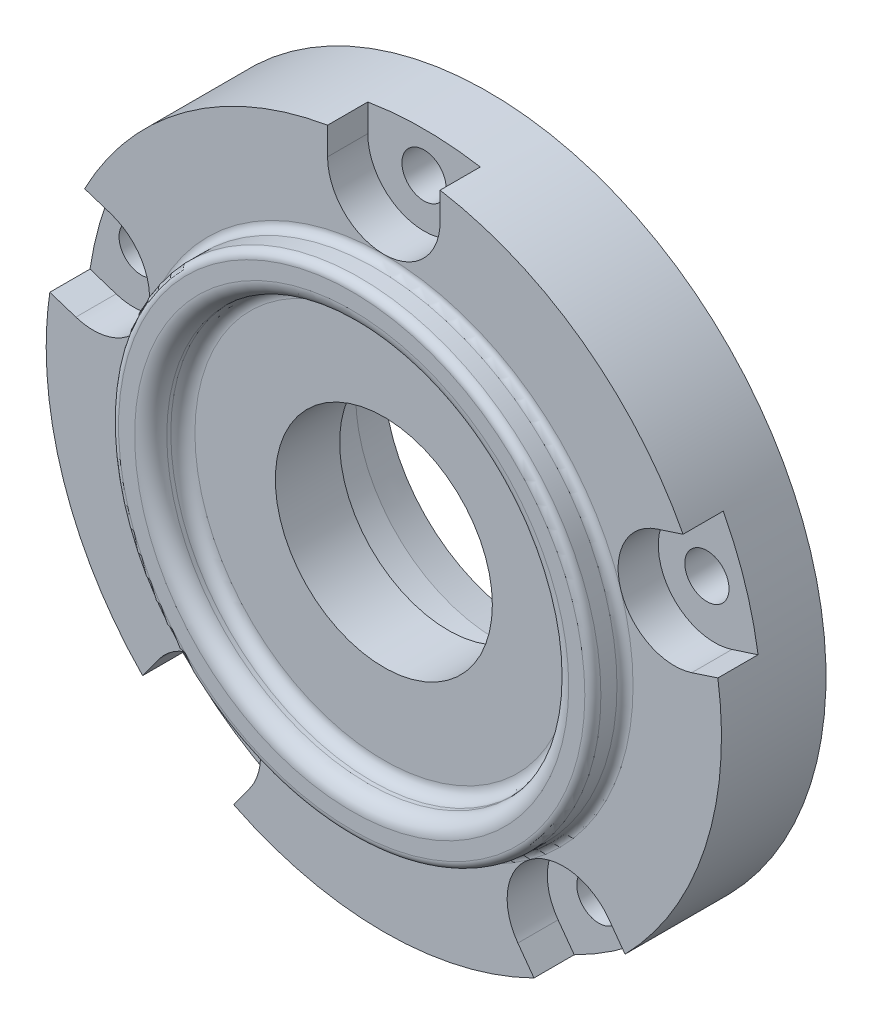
ISO-10303-21;
HEADER;
FILE_DESCRIPTION(('STEP AP214'),'2;1');
FILE_NAME('part.step','',(''),(''),'','','');
FILE_SCHEMA(('AUTOMOTIVE_DESIGN { 1 0 10303 214 1 1 1 1 }'));
ENDSEC;
DATA;
#1=APPLICATION_CONTEXT('core data for automotive mechanical design processes');
#2=APPLICATION_PROTOCOL_DEFINITION('international standard','automotive_design',2000,#1);
#3=PRODUCT_CONTEXT('',#1,'mechanical');
#4=PRODUCT('Part','Part','',(#3));
#5=PRODUCT_RELATED_PRODUCT_CATEGORY('part','',(#4));
#6=PRODUCT_DEFINITION_FORMATION('','',#4);
#7=PRODUCT_DEFINITION_CONTEXT('part definition',#1,'design');
#8=PRODUCT_DEFINITION('design','',#6,#7);
#9=PRODUCT_DEFINITION_SHAPE('','',#8);
#10=(LENGTH_UNIT() NAMED_UNIT(*) SI_UNIT(.MILLI.,.METRE.));
#11=(NAMED_UNIT(*) PLANE_ANGLE_UNIT() SI_UNIT($,.RADIAN.));
#12=(NAMED_UNIT(*) SI_UNIT($,.STERADIAN.) SOLID_ANGLE_UNIT());
#13=UNCERTAINTY_MEASURE_WITH_UNIT(LENGTH_MEASURE(1.E-05),#10,'distance_accuracy_value','');
#14=(GEOMETRIC_REPRESENTATION_CONTEXT(3) GLOBAL_UNCERTAINTY_ASSIGNED_CONTEXT((#13)) GLOBAL_UNIT_ASSIGNED_CONTEXT((#10,
#11,#12)) REPRESENTATION_CONTEXT('',''));
#15=CARTESIAN_POINT('',(0.,0.,0.));
#16=DIRECTION('',(0.,0.,1.));
#17=DIRECTION('',(1.,0.,0.));
#18=AXIS2_PLACEMENT_3D('',#15,#16,#17);
#19=CARTESIAN_POINT('',(0.,0.,18.));
#20=DIRECTION('',(0.,0.,1.));
#21=DIRECTION('',(1.,0.,0.));
#22=AXIS2_PLACEMENT_3D('',#19,#20,#21);
#23=PLANE('',#22);
#24=DIRECTION('',(0.95105651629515,-0.309016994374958,0.));
#25=VECTOR('',#24,1.);
#26=CARTESIAN_POINT('',(-38.3032665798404,5.08525017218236,18.));
#27=LINE('',#26,#25);
#28=CARTESIAN_POINT('',(-41.5488025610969,6.13978873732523,18.));
#29=VERTEX_POINT('',#28);
#30=CARTESIAN_POINT('',(-38.3032665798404,5.08525017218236,18.));
#31=VERTEX_POINT('',#30);
#32=EDGE_CURVE('E202',#29,#31,#27,.T.);
#33=ORIENTED_EDGE('',*,*,#32,.F.);
#34=CARTESIAN_POINT('',(0.,0.,18.));
#35=DIRECTION('',(0.,0.,1.));
#36=DIRECTION('',(1.,0.,0.));
#37=AXIS2_PLACEMENT_3D('',#34,#35,#36);
#38=CIRCLE('',#37,42.);
#39=CARTESIAN_POINT('',(-30.0048100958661,-29.3889668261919,18.));
#40=VERTEX_POINT('',#39);
#41=EDGE_CURVE('E315',#29,#40,#38,.T.);
#42=ORIENTED_EDGE('',*,*,#41,.T.);
#43=DIRECTION('',(-0.58778525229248,-0.809016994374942,0.));
#44=VECTOR('',#43,1.);
#45=CARTESIAN_POINT('',(-27.9989585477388,-26.6281490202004,18.));
#46=LINE('',#45,#44);
#47=CARTESIAN_POINT('',(-27.9989585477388,-26.6281490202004,18.));
#48=VERTEX_POINT('',#47);
#49=EDGE_CURVE('E215',#48,#40,#46,.T.);
#50=ORIENTED_EDGE('',*,*,#49,.F.);
#51=CARTESIAN_POINT('',(-22.3358395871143,-30.7426457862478,18.));
#52=DIRECTION('',(0.,0.,1.));
#53=DIRECTION('',(-0.809016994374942,0.58778525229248,0.));
#54=AXIS2_PLACEMENT_3D('',#51,#52,#53);
#55=CIRCLE('',#54,7.);
#56=CARTESIAN_POINT('',(-18.2213428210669,-25.0795268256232,18.));
#57=VERTEX_POINT('',#56);
#58=EDGE_CURVE('E211',#57,#48,#55,.T.);
#59=ORIENTED_EDGE('',*,*,#58,.F.);
#60=CARTESIAN_POINT('',(0.,0.,18.));
#61=DIRECTION('',(0.,0.,1.));
#62=DIRECTION('',(1.,0.,0.));
#63=AXIS2_PLACEMENT_3D('',#60,#61,#62);
#64=CIRCLE('',#63,31.);
#65=CARTESIAN_POINT('',(-29.4827520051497,9.5795268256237,18.));
#66=VERTEX_POINT('',#65);
#67=EDGE_CURVE('E404',#57,#66,#64,.F.);
#68=ORIENTED_EDGE('',*,*,#67,.T.);
#69=CARTESIAN_POINT('',(-36.1401476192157,11.7426457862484,18.));
#70=DIRECTION('',(0.,0.,1.));
#71=DIRECTION('',(0.309016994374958,0.95105651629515,0.));
#72=AXIS2_PLACEMENT_3D('',#69,#70,#71);
#73=CIRCLE('',#72,7.);
#74=EDGE_CURVE('E184',#31,#66,#73,.T.);
#75=ORIENTED_EDGE('',*,*,#74,.F.);
#76=EDGE_LOOP('',(#33,#42,#50,#59,#68,#75));
#77=FACE_BOUND('',#76,.T.);
#78=ADVANCED_FACE('F24',(#77),#23,.T.);
#79=DIRECTION('',(0.58778525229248,0.809016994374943,0.));
#80=VECTOR('',#79,1.);
#81=CARTESIAN_POINT('',(-16.6727206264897,-34.8571425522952,18.));
#82=LINE('',#81,#80);
#83=CARTESIAN_POINT('',(-18.6785721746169,-37.6179603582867,18.));
#84=VERTEX_POINT('',#83);
#85=CARTESIAN_POINT('',(-16.6727206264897,-34.8571425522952,18.));
#86=VERTEX_POINT('',#85);
#87=EDGE_CURVE('E218',#84,#86,#82,.T.);
#88=ORIENTED_EDGE('',*,*,#87,.F.);
#89=CARTESIAN_POINT('',(18.6785721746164,-37.6179603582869,18.));
#90=VERTEX_POINT('',#89);
#91=EDGE_CURVE('E449',#84,#90,#38,.T.);
#92=ORIENTED_EDGE('',*,*,#91,.T.);
#93=DIRECTION('',(0.587785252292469,-0.809016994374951,0.));
#94=VECTOR('',#93,1.);
#95=CARTESIAN_POINT('',(16.6727206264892,-34.8571425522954,18.));
#96=LINE('',#95,#94);
#97=CARTESIAN_POINT('',(16.6727206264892,-34.8571425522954,18.));
#98=VERTEX_POINT('',#97);
#99=EDGE_CURVE('E234',#98,#90,#96,.T.);
#100=ORIENTED_EDGE('',*,*,#99,.F.);
#101=CARTESIAN_POINT('',(22.3358395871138,-30.7426457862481,18.));
#102=DIRECTION('',(0.,0.,1.));
#103=DIRECTION('',(-0.809016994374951,-0.587785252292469,0.));
#104=AXIS2_PLACEMENT_3D('',#101,#102,#103);
#105=CIRCLE('',#104,7.);
#106=CARTESIAN_POINT('',(18.2213428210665,-25.0795268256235,18.));
#107=VERTEX_POINT('',#106);
#108=EDGE_CURVE('E229',#107,#98,#105,.T.);
#109=ORIENTED_EDGE('',*,*,#108,.F.);
#110=EDGE_CURVE('E409',#107,#57,#64,.F.);
#111=ORIENTED_EDGE('',*,*,#110,.T.);
#112=EDGE_CURVE('E213',#86,#57,#55,.T.);
#113=ORIENTED_EDGE('',*,*,#112,.F.);
#114=EDGE_LOOP('',(#88,#92,#100,#109,#111,#113));
#115=FACE_BOUND('',#114,.T.);
#116=ADVANCED_FACE('F467',(#115),#23,.T.);
#117=DIRECTION('',(-0.587785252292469,0.80901699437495,0.));
#118=VECTOR('',#117,1.);
#119=CARTESIAN_POINT('',(27.9989585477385,-26.6281490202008,18.));
#120=LINE('',#119,#118);
#121=CARTESIAN_POINT('',(30.0048100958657,-29.3889668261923,18.));
#122=VERTEX_POINT('',#121);
#123=CARTESIAN_POINT('',(27.9989585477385,-26.6281490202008,18.));
#124=VERTEX_POINT('',#123);
#125=EDGE_CURVE('E237',#122,#124,#120,.T.);
#126=ORIENTED_EDGE('',*,*,#125,.F.);
#127=CARTESIAN_POINT('',(41.548802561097,6.13978873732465,18.));
#128=VERTEX_POINT('',#127);
#129=EDGE_CURVE('E448',#122,#128,#38,.T.);
#130=ORIENTED_EDGE('',*,*,#129,.T.);
#131=DIRECTION('',(0.951056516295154,0.309016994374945,0.));
#132=VECTOR('',#131,1.);
#133=CARTESIAN_POINT('',(38.3032665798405,5.08525017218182,18.));
#134=LINE('',#133,#132);
#135=CARTESIAN_POINT('',(38.3032665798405,5.08525017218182,18.));
#136=VERTEX_POINT('',#135);
#137=EDGE_CURVE('E255',#136,#128,#134,.T.);
#138=ORIENTED_EDGE('',*,*,#137,.F.);
#139=CARTESIAN_POINT('',(36.1401476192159,11.7426457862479,18.));
#140=DIRECTION('',(0.,0.,1.));
#141=DIRECTION('',(0.309016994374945,-0.951056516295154,0.));
#142=AXIS2_PLACEMENT_3D('',#139,#140,#141);
#143=CIRCLE('',#142,7.);
#144=CARTESIAN_POINT('',(29.4827520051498,9.57952682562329,18.));
#145=VERTEX_POINT('',#144);
#146=EDGE_CURVE('E250',#145,#136,#143,.T.);
#147=ORIENTED_EDGE('',*,*,#146,.F.);
#148=EDGE_CURVE('E345',#145,#107,#64,.F.);
#149=ORIENTED_EDGE('',*,*,#148,.T.);
#150=EDGE_CURVE('E232',#124,#107,#105,.T.);
#151=ORIENTED_EDGE('',*,*,#150,.F.);
#152=EDGE_LOOP('',(#126,#130,#138,#147,#149,#151));
#153=FACE_BOUND('',#152,.T.);
#154=ADVANCED_FACE('F430',(#153),#23,.T.);
#155=DIRECTION('',(-0.951056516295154,-0.309016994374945,0.));
#156=VECTOR('',#155,1.);
#157=CARTESIAN_POINT('',(33.9770286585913,18.400041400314,18.));
#158=LINE('',#157,#156);
#159=CARTESIAN_POINT('',(37.2225646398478,19.4545799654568,18.));
#160=VERTEX_POINT('',#159);
#161=CARTESIAN_POINT('',(33.9770286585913,18.400041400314,18.));
#162=VERTEX_POINT('',#161);
#163=EDGE_CURVE('E258',#160,#162,#158,.T.);
#164=ORIENTED_EDGE('',*,*,#163,.F.);
#165=CARTESIAN_POINT('',(7.,41.4125584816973,18.));
#166=VERTEX_POINT('',#165);
#167=EDGE_CURVE('E312',#160,#166,#38,.T.);
#168=ORIENTED_EDGE('',*,*,#167,.T.);
#169=DIRECTION('',(0.,1.,0.));
#170=VECTOR('',#169,1.);
#171=CARTESIAN_POINT('',(7.,38.,18.));
#172=LINE('',#171,#170);
#173=CARTESIAN_POINT('',(7.,38.,18.));
#174=VERTEX_POINT('',#173);
#175=EDGE_CURVE('E283',#174,#166,#172,.T.);
#176=ORIENTED_EDGE('',*,*,#175,.F.);
#177=CARTESIAN_POINT('',(0.,38.,18.));
#178=DIRECTION('',(0.,0.,1.));
#179=DIRECTION('',(1.,0.,0.));
#180=AXIS2_PLACEMENT_3D('',#177,#178,#179);
#181=CIRCLE('',#180,7.);
#182=CARTESIAN_POINT('',(0.,31.,18.));
#183=VERTEX_POINT('',#182);
#184=EDGE_CURVE('E279',#183,#174,#181,.T.);
#185=ORIENTED_EDGE('',*,*,#184,.F.);
#186=EDGE_CURVE('E341',#183,#145,#64,.F.);
#187=ORIENTED_EDGE('',*,*,#186,.T.);
#188=EDGE_CURVE('E253',#162,#145,#143,.T.);
#189=ORIENTED_EDGE('',*,*,#188,.F.);
#190=EDGE_LOOP('',(#164,#168,#176,#185,#187,#189));
#191=FACE_BOUND('',#190,.T.);
#192=ADVANCED_FACE('F420',(#191),#23,.T.);
#193=CARTESIAN_POINT('',(-33.977028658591,18.4000414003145,18.));
#194=VERTEX_POINT('',#193);
#195=EDGE_CURVE('E177',#66,#194,#73,.T.);
#196=ORIENTED_EDGE('',*,*,#195,.F.);
#197=EDGE_CURVE('E340',#66,#183,#64,.F.);
#198=ORIENTED_EDGE('',*,*,#197,.T.);
#199=CARTESIAN_POINT('',(-7.,38.,18.));
#200=VERTEX_POINT('',#199);
#201=EDGE_CURVE('E280',#200,#183,#181,.T.);
#202=ORIENTED_EDGE('',*,*,#201,.F.);
#203=DIRECTION('',(0.,-1.,0.));
#204=VECTOR('',#203,1.);
#205=CARTESIAN_POINT('',(-7.,38.,18.));
#206=LINE('',#205,#204);
#207=CARTESIAN_POINT('',(-7.,41.4125584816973,18.));
#208=VERTEX_POINT('',#207);
#209=EDGE_CURVE('E286',#208,#200,#206,.T.);
#210=ORIENTED_EDGE('',*,*,#209,.F.);
#211=CARTESIAN_POINT('',(-37.2225646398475,19.4545799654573,18.));
#212=VERTEX_POINT('',#211);
#213=EDGE_CURVE('E201',#208,#212,#38,.T.);
#214=ORIENTED_EDGE('',*,*,#213,.T.);
#215=DIRECTION('',(-0.95105651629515,0.309016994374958,0.));
#216=VECTOR('',#215,1.);
#217=CARTESIAN_POINT('',(-33.977028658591,18.4000414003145,18.));
#218=LINE('',#217,#216);
#219=EDGE_CURVE('E192',#194,#212,#218,.T.);
#220=ORIENTED_EDGE('',*,*,#219,.F.);
#221=EDGE_LOOP('',(#196,#198,#202,#210,#214,#220));
#222=FACE_BOUND('',#221,.T.);
#223=ADVANCED_FACE('F198',(#222),#23,.T.);
#224=CARTESIAN_POINT('',(0.,0.,0.));
#225=DIRECTION('',(0.,0.,1.));
#226=DIRECTION('',(1.,0.,0.));
#227=AXIS2_PLACEMENT_3D('',#224,#225,#226);
#228=PLANE('',#227);
#229=CARTESIAN_POINT('',(0.,0.,0.));
#230=DIRECTION('',(0.,0.,1.));
#231=DIRECTION('',(1.,0.,0.));
#232=AXIS2_PLACEMENT_3D('',#229,#230,#231);
#233=CIRCLE('',#232,18.);
#234=CARTESIAN_POINT('',(18.,0.,0.));
#235=VERTEX_POINT('',#234);
#236=EDGE_CURVE('E314',#235,#235,#233,.T.);
#237=ORIENTED_EDGE('',*,*,#236,.T.);
#238=EDGE_LOOP('',(#237));
#239=FACE_BOUND('',#238,.T.);
#240=CARTESIAN_POINT('',(0.,0.,0.));
#241=DIRECTION('',(0.,0.,-1.));
#242=DIRECTION('',(-1.,0.,0.));
#243=AXIS2_PLACEMENT_3D('',#240,#241,#242);
#244=CIRCLE('',#243,23.5);
#245=CARTESIAN_POINT('',(-23.5,0.,0.));
#246=VERTEX_POINT('',#245);
#247=EDGE_CURVE('E299',#246,#246,#244,.T.);
#248=ORIENTED_EDGE('',*,*,#247,.T.);
#249=EDGE_LOOP('',(#248));
#250=FACE_BOUND('',#249,.T.);
#251=ADVANCED_FACE('F511',(#239,#250),#228,.F.);
#252=CARTESIAN_POINT('',(0.,0.,18.));
#253=DIRECTION('',(0.,0.,-1.));
#254=DIRECTION('',(-1.,0.,0.));
#255=AXIS2_PLACEMENT_3D('',#252,#253,#254);
#256=CYLINDRICAL_SURFACE('',#255,42.);
#257=ORIENTED_EDGE('',*,*,#41,.F.);
#258=DIRECTION('',(0.,0.,-1.));
#259=VECTOR('',#258,1.);
#260=CARTESIAN_POINT('',(-41.5488025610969,6.13978873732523,18.));
#261=LINE('',#260,#259);
#262=CARTESIAN_POINT('',(-41.5488025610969,6.13978873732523,13.));
#263=VERTEX_POINT('',#262);
#264=EDGE_CURVE('E11',#29,#263,#261,.T.);
#265=ORIENTED_EDGE('',*,*,#264,.T.);
#266=CARTESIAN_POINT('',(0.,0.,13.));
#267=DIRECTION('',(0.,0.,1.));
#268=DIRECTION('',(1.,0.,0.));
#269=AXIS2_PLACEMENT_3D('',#266,#267,#268);
#270=CIRCLE('',#269,42.);
#271=CARTESIAN_POINT('',(-37.2225646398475,19.4545799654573,13.));
#272=VERTEX_POINT('',#271);
#273=EDGE_CURVE('E389',#272,#263,#270,.T.);
#274=ORIENTED_EDGE('',*,*,#273,.F.);
#275=DIRECTION('',(0.,0.,-1.));
#276=VECTOR('',#275,1.);
#277=CARTESIAN_POINT('',(-37.2225646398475,19.4545799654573,18.));
#278=LINE('',#277,#276);
#279=EDGE_CURVE('E32',#272,#212,#278,.F.);
#280=ORIENTED_EDGE('',*,*,#279,.T.);
#281=ORIENTED_EDGE('',*,*,#213,.F.);
#282=DIRECTION('',(0.,0.,-1.));
#283=VECTOR('',#282,1.);
#284=CARTESIAN_POINT('',(-7.,41.4125584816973,18.));
#285=LINE('',#284,#283);
#286=CARTESIAN_POINT('',(-7.,41.4125584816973,13.));
#287=VERTEX_POINT('',#286);
#288=EDGE_CURVE('E362',#208,#287,#285,.T.);
#289=ORIENTED_EDGE('',*,*,#288,.T.);
#290=CARTESIAN_POINT('',(0.,0.,13.));
#291=DIRECTION('',(0.,0.,1.));
#292=DIRECTION('',(1.,0.,0.));
#293=AXIS2_PLACEMENT_3D('',#290,#291,#292);
#294=CIRCLE('',#293,42.);
#295=CARTESIAN_POINT('',(7.,41.4125584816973,13.));
#296=VERTEX_POINT('',#295);
#297=EDGE_CURVE('E357',#296,#287,#294,.T.);
#298=ORIENTED_EDGE('',*,*,#297,.F.);
#299=DIRECTION('',(0.,0.,-1.));
#300=VECTOR('',#299,1.);
#301=CARTESIAN_POINT('',(7.,41.4125584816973,18.));
#302=LINE('',#301,#300);
#303=EDGE_CURVE('E359',#296,#166,#302,.F.);
#304=ORIENTED_EDGE('',*,*,#303,.T.);
#305=ORIENTED_EDGE('',*,*,#167,.F.);
#306=DIRECTION('',(0.,0.,-1.));
#307=VECTOR('',#306,1.);
#308=CARTESIAN_POINT('',(37.2225646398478,19.4545799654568,18.));
#309=LINE('',#308,#307);
#310=CARTESIAN_POINT('',(37.2225646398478,19.4545799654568,13.));
#311=VERTEX_POINT('',#310);
#312=EDGE_CURVE('E370',#160,#311,#309,.T.);
#313=ORIENTED_EDGE('',*,*,#312,.T.);
#314=CARTESIAN_POINT('',(0.,0.,13.));
#315=DIRECTION('',(0.,0.,1.));
#316=DIRECTION('',(1.,0.,0.));
#317=AXIS2_PLACEMENT_3D('',#314,#315,#316);
#318=CIRCLE('',#317,42.);
#319=CARTESIAN_POINT('',(41.548802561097,6.13978873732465,13.));
#320=VERTEX_POINT('',#319);
#321=EDGE_CURVE('E365',#320,#311,#318,.T.);
#322=ORIENTED_EDGE('',*,*,#321,.F.);
#323=DIRECTION('',(0.,0.,-1.));
#324=VECTOR('',#323,1.);
#325=CARTESIAN_POINT('',(41.548802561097,6.13978873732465,18.));
#326=LINE('',#325,#324);
#327=EDGE_CURVE('E367',#320,#128,#326,.F.);
#328=ORIENTED_EDGE('',*,*,#327,.T.);
#329=ORIENTED_EDGE('',*,*,#129,.F.);
#330=DIRECTION('',(0.,0.,-1.));
#331=VECTOR('',#330,1.);
#332=CARTESIAN_POINT('',(30.0048100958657,-29.3889668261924,18.));
#333=LINE('',#332,#331);
#334=CARTESIAN_POINT('',(30.0048100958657,-29.3889668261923,13.));
#335=VERTEX_POINT('',#334);
#336=EDGE_CURVE('E378',#122,#335,#333,.T.);
#337=ORIENTED_EDGE('',*,*,#336,.T.);
#338=CARTESIAN_POINT('',(0.,0.,13.));
#339=DIRECTION('',(0.,0.,1.));
#340=DIRECTION('',(1.,0.,0.));
#341=AXIS2_PLACEMENT_3D('',#338,#339,#340);
#342=CIRCLE('',#341,42.);
#343=CARTESIAN_POINT('',(18.6785721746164,-37.6179603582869,13.));
#344=VERTEX_POINT('',#343);
#345=EDGE_CURVE('E373',#344,#335,#342,.T.);
#346=ORIENTED_EDGE('',*,*,#345,.F.);
#347=DIRECTION('',(0.,0.,-1.));
#348=VECTOR('',#347,1.);
#349=CARTESIAN_POINT('',(18.6785721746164,-37.6179603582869,18.));
#350=LINE('',#349,#348);
#351=EDGE_CURVE('E375',#344,#90,#350,.F.);
#352=ORIENTED_EDGE('',*,*,#351,.T.);
#353=ORIENTED_EDGE('',*,*,#91,.F.);
#354=DIRECTION('',(0.,0.,-1.));
#355=VECTOR('',#354,1.);
#356=CARTESIAN_POINT('',(-18.6785721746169,-37.6179603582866,18.));
#357=LINE('',#356,#355);
#358=CARTESIAN_POINT('',(-18.6785721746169,-37.6179603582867,13.));
#359=VERTEX_POINT('',#358);
#360=EDGE_CURVE('E386',#84,#359,#357,.T.);
#361=ORIENTED_EDGE('',*,*,#360,.T.);
#362=CARTESIAN_POINT('',(0.,0.,13.));
#363=DIRECTION('',(0.,0.,1.));
#364=DIRECTION('',(1.,0.,0.));
#365=AXIS2_PLACEMENT_3D('',#362,#363,#364);
#366=CIRCLE('',#365,42.);
#367=CARTESIAN_POINT('',(-30.0048100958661,-29.3889668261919,13.));
#368=VERTEX_POINT('',#367);
#369=EDGE_CURVE('E381',#368,#359,#366,.T.);
#370=ORIENTED_EDGE('',*,*,#369,.F.);
#371=DIRECTION('',(0.,0.,-1.));
#372=VECTOR('',#371,1.);
#373=CARTESIAN_POINT('',(-30.0048100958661,-29.3889668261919,18.));
#374=LINE('',#373,#372);
#375=EDGE_CURVE('E383',#368,#40,#374,.F.);
#376=ORIENTED_EDGE('',*,*,#375,.T.);
#377=EDGE_LOOP('',(#257,#265,#274,#280,#281,#289,#298,#304,#305,#313,#322,#328,#329,#337,#346,
#352,#353,#361,#370,#376));
#378=FACE_BOUND('',#377,.T.);
#379=CARTESIAN_POINT('',(0.,0.,5.));
#380=DIRECTION('',(0.,0.,-1.));
#381=DIRECTION('',(-1.,0.,0.));
#382=AXIS2_PLACEMENT_3D('',#379,#380,#381);
#383=CIRCLE('',#382,42.);
#384=CARTESIAN_POINT('',(-42.,0.,5.));
#385=VERTEX_POINT('',#384);
#386=EDGE_CURVE('E304',#385,#385,#383,.T.);
#387=ORIENTED_EDGE('',*,*,#386,.F.);
#388=EDGE_LOOP('',(#387));
#389=FACE_BOUND('',#388,.T.);
#390=ADVANCED_FACE('F26',(#378,#389),#256,.T.);
#391=CARTESIAN_POINT('',(0.,0.,18.));
#392=DIRECTION('',(0.,0.,1.));
#393=DIRECTION('',(1.,0.,0.));
#394=AXIS2_PLACEMENT_3D('',#391,#392,#393);
#395=CIRCLE('',#394,23.5);
#396=CARTESIAN_POINT('',(23.5,0.,18.));
#397=VERTEX_POINT('',#396);
#398=EDGE_CURVE('E354',#397,#397,#395,.T.);
#399=ORIENTED_EDGE('',*,*,#398,.T.);
#400=EDGE_LOOP('',(#399));
#401=FACE_BOUND('',#400,.T.);
#402=CARTESIAN_POINT('',(0.,0.,18.));
#403=DIRECTION('',(0.,0.,1.));
#404=DIRECTION('',(1.,0.,0.));
#405=AXIS2_PLACEMENT_3D('',#402,#403,#404);
#406=CIRCLE('',#405,13.5);
#407=CARTESIAN_POINT('',(13.5,0.,18.));
#408=VERTEX_POINT('',#407);
#409=EDGE_CURVE('E309',#408,#408,#406,.T.);
#410=ORIENTED_EDGE('',*,*,#409,.F.);
#411=EDGE_LOOP('',(#410));
#412=FACE_BOUND('',#411,.T.);
#413=ADVANCED_FACE('F496',(#401,#412),#23,.T.);
#414=CARTESIAN_POINT('',(0.,0.,18.));
#415=DIRECTION('',(0.,0.,-1.));
#416=DIRECTION('',(-1.,0.,0.));
#417=AXIS2_PLACEMENT_3D('',#414,#415,#416);
#418=CYLINDRICAL_SURFACE('',#417,13.5);
#419=CARTESIAN_POINT('',(0.,0.,10.));
#420=DIRECTION('',(0.,0.,1.));
#421=DIRECTION('',(1.,0.,0.));
#422=AXIS2_PLACEMENT_3D('',#419,#420,#421);
#423=CIRCLE('',#422,13.5);
#424=CARTESIAN_POINT('',(13.5,0.,10.));
#425=VERTEX_POINT('',#424);
#426=EDGE_CURVE('E308',#425,#425,#423,.T.);
#427=ORIENTED_EDGE('',*,*,#426,.F.);
#428=EDGE_LOOP('',(#427));
#429=FACE_BOUND('',#428,.T.);
#430=ORIENTED_EDGE('',*,*,#409,.T.);
#431=EDGE_LOOP('',(#430));
#432=FACE_BOUND('',#431,.T.);
#433=ADVANCED_FACE('F502',(#429,#432),#418,.F.);
#434=CARTESIAN_POINT('',(0.,0.,10.));
#435=DIRECTION('',(0.,0.,-1.));
#436=DIRECTION('',(-1.,0.,0.));
#437=AXIS2_PLACEMENT_3D('',#434,#435,#436);
#438=CYLINDRICAL_SURFACE('',#437,17.5);
#439=CARTESIAN_POINT('',(0.,0.,4.));
#440=DIRECTION('',(0.,0.,1.));
#441=DIRECTION('',(1.,0.,0.));
#442=AXIS2_PLACEMENT_3D('',#439,#440,#441);
#443=CIRCLE('',#442,17.5);
#444=CARTESIAN_POINT('',(17.5,0.,4.));
#445=VERTEX_POINT('',#444);
#446=EDGE_CURVE('E322',#445,#445,#443,.F.);
#447=ORIENTED_EDGE('',*,*,#446,.T.);
#448=EDGE_LOOP('',(#447));
#449=FACE_BOUND('',#448,.T.);
#450=CARTESIAN_POINT('',(0.,0.,10.));
#451=DIRECTION('',(0.,0.,1.));
#452=DIRECTION('',(1.,0.,0.));
#453=AXIS2_PLACEMENT_3D('',#450,#451,#452);
#454=CIRCLE('',#453,17.5);
#455=CARTESIAN_POINT('',(17.5,0.,10.));
#456=VERTEX_POINT('',#455);
#457=EDGE_CURVE('E305',#456,#456,#454,.T.);
#458=ORIENTED_EDGE('',*,*,#457,.T.);
#459=EDGE_LOOP('',(#458));
#460=FACE_BOUND('',#459,.T.);
#461=ADVANCED_FACE('F508',(#449,#460),#438,.F.);
#462=CARTESIAN_POINT('',(0.,0.,10.));
#463=DIRECTION('',(0.,0.,1.));
#464=DIRECTION('',(1.,0.,0.));
#465=AXIS2_PLACEMENT_3D('',#462,#463,#464);
#466=PLANE('',#465);
#467=ORIENTED_EDGE('',*,*,#426,.T.);
#468=EDGE_LOOP('',(#467));
#469=FACE_BOUND('',#468,.T.);
#470=ORIENTED_EDGE('',*,*,#457,.F.);
#471=EDGE_LOOP('',(#470));
#472=FACE_BOUND('',#471,.T.);
#473=ADVANCED_FACE('F689',(#469,#472),#466,.F.);
#474=CARTESIAN_POINT('',(0.,0.,5.));
#475=DIRECTION('',(0.,0.,-1.));
#476=DIRECTION('',(-1.,0.,0.));
#477=AXIS2_PLACEMENT_3D('',#474,#475,#476);
#478=PLANE('',#477);
#479=CARTESIAN_POINT('',(-35.1890911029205,11.4336287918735,5.));
#480=DIRECTION('',(0.,0.,-1.));
#481=DIRECTION('',(-1.,0.,0.));
#482=AXIS2_PLACEMENT_3D('',#479,#480,#481);
#483=CIRCLE('',#482,2.75);
#484=CARTESIAN_POINT('',(-37.9390911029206,11.4336287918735,5.));
#485=VERTEX_POINT('',#484);
#486=EDGE_CURVE('E660',#485,#485,#483,.T.);
#487=ORIENTED_EDGE('',*,*,#486,.F.);
#488=EDGE_LOOP('',(#487));
#489=FACE_BOUND('',#488,.T.);
#490=CARTESIAN_POINT('',(-21.7480543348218,-29.9336287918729,5.));
#491=DIRECTION('',(0.,0.,-1.));
#492=DIRECTION('',(-1.,0.,0.));
#493=AXIS2_PLACEMENT_3D('',#490,#491,#492);
#494=CIRCLE('',#493,2.75);
#495=CARTESIAN_POINT('',(-24.4980543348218,-29.9336287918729,5.));
#496=VERTEX_POINT('',#495);
#497=EDGE_CURVE('E670',#496,#496,#494,.T.);
#498=ORIENTED_EDGE('',*,*,#497,.F.);
#499=EDGE_LOOP('',(#498));
#500=FACE_BOUND('',#499,.T.);
#501=CARTESIAN_POINT('',(21.7480543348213,-29.9336287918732,5.));
#502=DIRECTION('',(0.,0.,-1.));
#503=DIRECTION('',(-1.,0.,0.));
#504=AXIS2_PLACEMENT_3D('',#501,#502,#503);
#505=CIRCLE('',#504,2.75);
#506=CARTESIAN_POINT('',(18.9980543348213,-29.9336287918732,5.));
#507=VERTEX_POINT('',#506);
#508=EDGE_CURVE('E676',#507,#507,#505,.T.);
#509=ORIENTED_EDGE('',*,*,#508,.F.);
#510=EDGE_LOOP('',(#509));
#511=FACE_BOUND('',#510,.T.);
#512=CARTESIAN_POINT('',(35.1890911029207,11.433628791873,5.));
#513=DIRECTION('',(0.,0.,-1.));
#514=DIRECTION('',(-1.,0.,0.));
#515=AXIS2_PLACEMENT_3D('',#512,#513,#514);
#516=CIRCLE('',#515,2.75);
#517=CARTESIAN_POINT('',(32.4390911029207,11.433628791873,5.));
#518=VERTEX_POINT('',#517);
#519=EDGE_CURVE('E188',#518,#518,#516,.T.);
#520=ORIENTED_EDGE('',*,*,#519,.F.);
#521=EDGE_LOOP('',(#520));
#522=FACE_BOUND('',#521,.T.);
#523=CARTESIAN_POINT('',(0.,37.,5.));
#524=DIRECTION('',(0.,0.,-1.));
#525=DIRECTION('',(-1.,0.,0.));
#526=AXIS2_PLACEMENT_3D('',#523,#524,#525);
#527=CIRCLE('',#526,2.75);
#528=CARTESIAN_POINT('',(-2.75,37.,5.));
#529=VERTEX_POINT('',#528);
#530=EDGE_CURVE('E276',#529,#529,#527,.T.);
#531=ORIENTED_EDGE('',*,*,#530,.F.);
#532=EDGE_LOOP('',(#531));
#533=FACE_BOUND('',#532,.T.);
#534=CARTESIAN_POINT('',(0.,0.,5.));
#535=DIRECTION('',(0.,0.,-1.));
#536=DIRECTION('',(-1.,0.,0.));
#537=AXIS2_PLACEMENT_3D('',#534,#535,#536);
#538=CIRCLE('',#537,24.5);
#539=CARTESIAN_POINT('',(-24.5,0.,5.));
#540=VERTEX_POINT('',#539);
#541=EDGE_CURVE('E348',#540,#540,#538,.F.);
#542=ORIENTED_EDGE('',*,*,#541,.T.);
#543=EDGE_LOOP('',(#542));
#544=FACE_BOUND('',#543,.T.);
#545=ORIENTED_EDGE('',*,*,#386,.T.);
#546=EDGE_LOOP('',(#545));
#547=FACE_BOUND('',#546,.T.);
#548=ADVANCED_FACE('F685',(#489,#500,#511,#522,#533,#544,#547),#478,.T.);
#549=CARTESIAN_POINT('',(0.,0.,5.));
#550=DIRECTION('',(0.,0.,-1.));
#551=DIRECTION('',(-1.,0.,0.));
#552=AXIS2_PLACEMENT_3D('',#549,#550,#551);
#553=CYLINDRICAL_SURFACE('',#552,23.5);
#554=CARTESIAN_POINT('',(0.,0.,4.));
#555=DIRECTION('',(0.,0.,-1.));
#556=DIRECTION('',(-1.,0.,0.));
#557=AXIS2_PLACEMENT_3D('',#554,#555,#556);
#558=CIRCLE('',#557,23.5);
#559=CARTESIAN_POINT('',(-23.5,0.,4.));
#560=VERTEX_POINT('',#559);
#561=EDGE_CURVE('E344',#560,#560,#558,.T.);
#562=ORIENTED_EDGE('',*,*,#561,.T.);
#563=EDGE_LOOP('',(#562));
#564=FACE_BOUND('',#563,.T.);
#565=ORIENTED_EDGE('',*,*,#247,.F.);
#566=EDGE_LOOP('',(#565));
#567=FACE_BOUND('',#566,.T.);
#568=ADVANCED_FACE('F688',(#564,#567),#553,.T.);
#569=CARTESIAN_POINT('',(0.,0.,0.));
#570=DIRECTION('',(0.,0.,-1.));
#571=DIRECTION('',(-1.,0.,0.));
#572=AXIS2_PLACEMENT_3D('',#569,#570,#571);
#573=CONICAL_SURFACE('',#572,18.,0.124354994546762);
#574=ORIENTED_EDGE('',*,*,#446,.F.);
#575=EDGE_LOOP('',(#574));
#576=FACE_BOUND('',#575,.T.);
#577=ORIENTED_EDGE('',*,*,#236,.F.);
#578=EDGE_LOOP('',(#577));
#579=FACE_BOUND('',#578,.T.);
#580=ADVANCED_FACE('F707',(#576,#579),#573,.F.);
#581=CARTESIAN_POINT('',(0.,0.,22.));
#582=DIRECTION('',(0.,0.,1.));
#583=DIRECTION('',(1.,0.,0.));
#584=AXIS2_PLACEMENT_3D('',#581,#582,#583);
#585=PLANE('',#584);
#586=CARTESIAN_POINT('',(0.,0.,22.));
#587=DIRECTION('',(0.,0.,1.));
#588=DIRECTION('',(1.,0.,0.));
#589=AXIS2_PLACEMENT_3D('',#586,#587,#588);
#590=CIRCLE('',#589,27.);
#591=CARTESIAN_POINT('',(27.,0.,22.));
#592=VERTEX_POINT('',#591);
#593=EDGE_CURVE('E334',#592,#592,#590,.F.);
#594=ORIENTED_EDGE('',*,*,#593,.T.);
#595=EDGE_LOOP('',(#594));
#596=FACE_BOUND('',#595,.T.);
#597=CARTESIAN_POINT('',(0.,0.,22.));
#598=DIRECTION('',(0.,0.,1.));
#599=DIRECTION('',(1.,0.,0.));
#600=AXIS2_PLACEMENT_3D('',#597,#598,#599);
#601=CIRCLE('',#600,29.);
#602=CARTESIAN_POINT('',(29.,0.,22.));
#603=VERTEX_POINT('',#602);
#604=EDGE_CURVE('E325',#603,#603,#601,.T.);
#605=ORIENTED_EDGE('',*,*,#604,.T.);
#606=EDGE_LOOP('',(#605));
#607=FACE_BOUND('',#606,.T.);
#608=ADVANCED_FACE('F714',(#596,#607),#585,.T.);
#609=CARTESIAN_POINT('',(0.,0.,22.));
#610=DIRECTION('',(0.,0.,-1.));
#611=DIRECTION('',(-1.,0.,0.));
#612=AXIS2_PLACEMENT_3D('',#609,#610,#611);
#613=CYLINDRICAL_SURFACE('',#612,30.);
#614=CARTESIAN_POINT('',(0.,0.,19.));
#615=DIRECTION('',(0.,0.,1.));
#616=DIRECTION('',(1.,0.,0.));
#617=AXIS2_PLACEMENT_3D('',#614,#615,#616);
#618=CIRCLE('',#617,30.);
#619=CARTESIAN_POINT('',(30.,0.,19.));
#620=VERTEX_POINT('',#619);
#621=EDGE_CURVE('E337',#620,#620,#618,.T.);
#622=ORIENTED_EDGE('',*,*,#621,.T.);
#623=EDGE_LOOP('',(#622));
#624=FACE_BOUND('',#623,.T.);
#625=CARTESIAN_POINT('',(0.,0.,21.));
#626=DIRECTION('',(0.,0.,1.));
#627=DIRECTION('',(1.,0.,0.));
#628=AXIS2_PLACEMENT_3D('',#625,#626,#627);
#629=CIRCLE('',#628,30.);
#630=CARTESIAN_POINT('',(30.,0.,21.));
#631=VERTEX_POINT('',#630);
#632=EDGE_CURVE('E328',#631,#631,#629,.F.);
#633=ORIENTED_EDGE('',*,*,#632,.T.);
#634=EDGE_LOOP('',(#633));
#635=FACE_BOUND('',#634,.T.);
#636=ADVANCED_FACE('F761',(#624,#635),#613,.T.);
#637=CARTESIAN_POINT('',(0.,0.,22.));
#638=DIRECTION('',(0.,0.,-1.));
#639=DIRECTION('',(-1.,0.,0.));
#640=AXIS2_PLACEMENT_3D('',#637,#638,#639);
#641=CYLINDRICAL_SURFACE('',#640,25.);
#642=CARTESIAN_POINT('',(0.,0.,19.5));
#643=DIRECTION('',(0.,0.,1.));
#644=DIRECTION('',(1.,0.,0.));
#645=AXIS2_PLACEMENT_3D('',#642,#643,#644);
#646=CIRCLE('',#645,25.);
#647=CARTESIAN_POINT('',(25.,0.,19.5));
#648=VERTEX_POINT('',#647);
#649=EDGE_CURVE('E351',#648,#648,#646,.F.);
#650=ORIENTED_EDGE('',*,*,#649,.T.);
#651=EDGE_LOOP('',(#650));
#652=FACE_BOUND('',#651,.T.);
#653=CARTESIAN_POINT('',(0.,0.,20.));
#654=DIRECTION('',(0.,0.,1.));
#655=DIRECTION('',(1.,0.,0.));
#656=AXIS2_PLACEMENT_3D('',#653,#654,#655);
#657=CIRCLE('',#656,25.);
#658=CARTESIAN_POINT('',(25.,0.,20.));
#659=VERTEX_POINT('',#658);
#660=EDGE_CURVE('E331',#659,#659,#657,.T.);
#661=ORIENTED_EDGE('',*,*,#660,.T.);
#662=EDGE_LOOP('',(#661));
#663=FACE_BOUND('',#662,.T.);
#664=ADVANCED_FACE('F769',(#652,#663),#641,.F.);
#665=CARTESIAN_POINT('',(0.,0.,21.));
#666=DIRECTION('',(0.,0.,1.));
#667=DIRECTION('',(1.,0.,0.));
#668=AXIS2_PLACEMENT_3D('',#665,#666,#667);
#669=TOROIDAL_SURFACE('',#668,29.,1.);
#670=ORIENTED_EDGE('',*,*,#632,.F.);
#671=EDGE_LOOP('',(#670));
#672=FACE_BOUND('',#671,.T.);
#673=ORIENTED_EDGE('',*,*,#604,.F.);
#674=EDGE_LOOP('',(#673));
#675=FACE_BOUND('',#674,.T.);
#676=ADVANCED_FACE('F776',(#672,#675),#669,.T.);
#677=CARTESIAN_POINT('',(0.,0.,20.));
#678=DIRECTION('',(0.,0.,1.));
#679=DIRECTION('',(1.,0.,0.));
#680=AXIS2_PLACEMENT_3D('',#677,#678,#679);
#681=TOROIDAL_SURFACE('',#680,27.,2.);
#682=ORIENTED_EDGE('',*,*,#593,.F.);
#683=EDGE_LOOP('',(#682));
#684=FACE_BOUND('',#683,.T.);
#685=ORIENTED_EDGE('',*,*,#660,.F.);
#686=EDGE_LOOP('',(#685));
#687=FACE_BOUND('',#686,.T.);
#688=ADVANCED_FACE('F784',(#684,#687),#681,.T.);
#689=CARTESIAN_POINT('',(0.,0.,19.));
#690=DIRECTION('',(0.,0.,1.));
#691=DIRECTION('',(1.,0.,0.));
#692=AXIS2_PLACEMENT_3D('',#689,#690,#691);
#693=TOROIDAL_SURFACE('',#692,31.,1.);
#694=ORIENTED_EDGE('',*,*,#186,.F.);
#695=ORIENTED_EDGE('',*,*,#197,.F.);
#696=ORIENTED_EDGE('',*,*,#67,.F.);
#697=ORIENTED_EDGE('',*,*,#110,.F.);
#698=ORIENTED_EDGE('',*,*,#148,.F.);
#699=EDGE_LOOP('',(#694,#695,#696,#697,#698));
#700=FACE_BOUND('',#699,.T.);
#701=ORIENTED_EDGE('',*,*,#621,.F.);
#702=EDGE_LOOP('',(#701));
#703=FACE_BOUND('',#702,.T.);
#704=ADVANCED_FACE('F423',(#700,#703),#693,.F.);
#705=CARTESIAN_POINT('',(0.,0.,4.));
#706=DIRECTION('',(0.,0.,-1.));
#707=DIRECTION('',(-1.,0.,0.));
#708=AXIS2_PLACEMENT_3D('',#705,#706,#707);
#709=TOROIDAL_SURFACE('',#708,24.5,1.);
#710=ORIENTED_EDGE('',*,*,#541,.F.);
#711=EDGE_LOOP('',(#710));
#712=FACE_BOUND('',#711,.T.);
#713=ORIENTED_EDGE('',*,*,#561,.F.);
#714=EDGE_LOOP('',(#713));
#715=FACE_BOUND('',#714,.T.);
#716=ADVANCED_FACE('F698',(#712,#715),#709,.F.);
#717=CARTESIAN_POINT('',(0.,0.,19.5));
#718=DIRECTION('',(0.,0.,1.));
#719=DIRECTION('',(1.,0.,0.));
#720=AXIS2_PLACEMENT_3D('',#717,#718,#719);
#721=TOROIDAL_SURFACE('',#720,23.5,1.5);
#722=ORIENTED_EDGE('',*,*,#398,.F.);
#723=EDGE_LOOP('',(#722));
#724=FACE_BOUND('',#723,.T.);
#725=ORIENTED_EDGE('',*,*,#649,.F.);
#726=EDGE_LOOP('',(#725));
#727=FACE_BOUND('',#726,.T.);
#728=ADVANCED_FACE('F701',(#724,#727),#721,.F.);
#729=CARTESIAN_POINT('',(-7.,38.,13.));
#730=DIRECTION('',(-1.,0.,0.));
#731=DIRECTION('',(0.,-1.,0.));
#732=AXIS2_PLACEMENT_3D('',#729,#730,#731);
#733=PLANE('',#732);
#734=ORIENTED_EDGE('',*,*,#209,.T.);
#735=DIRECTION('',(0.,0.,1.));
#736=VECTOR('',#735,1.);
#737=CARTESIAN_POINT('',(-7.,38.,13.));
#738=LINE('',#737,#736);
#739=CARTESIAN_POINT('',(-7.,38.,13.));
#740=VERTEX_POINT('',#739);
#741=EDGE_CURVE('E296',#740,#200,#738,.T.);
#742=ORIENTED_EDGE('',*,*,#741,.F.);
#743=DIRECTION('',(0.,-1.,0.));
#744=VECTOR('',#743,1.);
#745=CARTESIAN_POINT('',(-7.,38.,13.));
#746=LINE('',#745,#744);
#747=EDGE_CURVE('E293',#287,#740,#746,.T.);
#748=ORIENTED_EDGE('',*,*,#747,.F.);
#749=ORIENTED_EDGE('',*,*,#288,.F.);
#750=EDGE_LOOP('',(#734,#742,#748,#749));
#751=FACE_BOUND('',#750,.T.);
#752=ADVANCED_FACE('F809',(#751),#733,.F.);
#753=CARTESIAN_POINT('',(7.,38.,13.));
#754=DIRECTION('',(1.,0.,0.));
#755=DIRECTION('',(0.,0.,-1.));
#756=AXIS2_PLACEMENT_3D('',#753,#754,#755);
#757=PLANE('',#756);
#758=DIRECTION('',(0.,1.,0.));
#759=VECTOR('',#758,1.);
#760=CARTESIAN_POINT('',(7.,38.,13.));
#761=LINE('',#760,#759);
#762=CARTESIAN_POINT('',(7.,38.,13.));
#763=VERTEX_POINT('',#762);
#764=EDGE_CURVE('E291',#763,#296,#761,.T.);
#765=ORIENTED_EDGE('',*,*,#764,.F.);
#766=DIRECTION('',(0.,0.,1.));
#767=VECTOR('',#766,1.);
#768=CARTESIAN_POINT('',(7.,38.,13.));
#769=LINE('',#768,#767);
#770=EDGE_CURVE('E295',#763,#174,#769,.T.);
#771=ORIENTED_EDGE('',*,*,#770,.T.);
#772=ORIENTED_EDGE('',*,*,#175,.T.);
#773=ORIENTED_EDGE('',*,*,#303,.F.);
#774=EDGE_LOOP('',(#765,#771,#772,#773));
#775=FACE_BOUND('',#774,.T.);
#776=ADVANCED_FACE('F817',(#775),#757,.F.);
#777=CARTESIAN_POINT('',(0.,38.,13.));
#778=DIRECTION('',(0.,0.,1.));
#779=DIRECTION('',(1.,0.,0.));
#780=AXIS2_PLACEMENT_3D('',#777,#778,#779);
#781=PLANE('',#780);
#782=CARTESIAN_POINT('',(0.,37.,13.));
#783=DIRECTION('',(0.,0.,1.));
#784=DIRECTION('',(1.,0.,0.));
#785=AXIS2_PLACEMENT_3D('',#782,#783,#784);
#786=CIRCLE('',#785,2.75);
#787=CARTESIAN_POINT('',(2.75,37.,13.));
#788=VERTEX_POINT('',#787);
#789=EDGE_CURVE('E271',#788,#788,#786,.T.);
#790=ORIENTED_EDGE('',*,*,#789,.F.);
#791=EDGE_LOOP('',(#790));
#792=FACE_BOUND('',#791,.T.);
#793=ORIENTED_EDGE('',*,*,#297,.T.);
#794=ORIENTED_EDGE('',*,*,#747,.T.);
#795=CARTESIAN_POINT('',(0.,38.,13.));
#796=DIRECTION('',(0.,0.,1.));
#797=DIRECTION('',(1.,0.,0.));
#798=AXIS2_PLACEMENT_3D('',#795,#796,#797);
#799=CIRCLE('',#798,7.);
#800=EDGE_CURVE('E288',#740,#763,#799,.T.);
#801=ORIENTED_EDGE('',*,*,#800,.T.);
#802=ORIENTED_EDGE('',*,*,#764,.T.);
#803=EDGE_LOOP('',(#793,#794,#801,#802));
#804=FACE_BOUND('',#803,.T.);
#805=ADVANCED_FACE('F825',(#792,#804),#781,.T.);
#806=CARTESIAN_POINT('',(0.,38.,13.));
#807=DIRECTION('',(0.,0.,1.));
#808=DIRECTION('',(1.,0.,0.));
#809=AXIS2_PLACEMENT_3D('',#806,#807,#808);
#810=CYLINDRICAL_SURFACE('',#809,7.);
#811=ORIENTED_EDGE('',*,*,#201,.T.);
#812=ORIENTED_EDGE('',*,*,#184,.T.);
#813=ORIENTED_EDGE('',*,*,#770,.F.);
#814=ORIENTED_EDGE('',*,*,#800,.F.);
#815=ORIENTED_EDGE('',*,*,#741,.T.);
#816=EDGE_LOOP('',(#811,#812,#813,#814,#815));
#817=FACE_BOUND('',#816,.T.);
#818=ADVANCED_FACE('F414',(#817),#810,.F.);
#819=CARTESIAN_POINT('',(0.,37.,0.));
#820=DIRECTION('',(0.,0.,1.));
#821=DIRECTION('',(1.,0.,0.));
#822=AXIS2_PLACEMENT_3D('',#819,#820,#821);
#823=CYLINDRICAL_SURFACE('',#822,2.75);
#824=ORIENTED_EDGE('',*,*,#530,.T.);
#825=EDGE_LOOP('',(#824));
#826=FACE_BOUND('',#825,.T.);
#827=ORIENTED_EDGE('',*,*,#789,.T.);
#828=EDGE_LOOP('',(#827));
#829=FACE_BOUND('',#828,.T.);
#830=ADVANCED_FACE('F485',(#826,#829),#823,.F.);
#831=CARTESIAN_POINT('',(33.9770286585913,18.400041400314,13.));
#832=DIRECTION('',(-0.309016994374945,0.951056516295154,0.));
#833=DIRECTION('',(-0.951056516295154,-0.309016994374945,0.));
#834=AXIS2_PLACEMENT_3D('',#831,#832,#833);
#835=PLANE('',#834);
#836=ORIENTED_EDGE('',*,*,#163,.T.);
#837=DIRECTION('',(0.,0.,1.));
#838=VECTOR('',#837,1.);
#839=CARTESIAN_POINT('',(33.9770286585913,18.400041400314,13.));
#840=LINE('',#839,#838);
#841=CARTESIAN_POINT('',(33.9770286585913,18.400041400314,13.));
#842=VERTEX_POINT('',#841);
#843=EDGE_CURVE('E268',#842,#162,#840,.T.);
#844=ORIENTED_EDGE('',*,*,#843,.F.);
#845=DIRECTION('',(-0.951056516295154,-0.309016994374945,0.));
#846=VECTOR('',#845,1.);
#847=CARTESIAN_POINT('',(33.9770286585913,18.400041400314,13.));
#848=LINE('',#847,#846);
#849=EDGE_CURVE('E265',#311,#842,#848,.T.);
#850=ORIENTED_EDGE('',*,*,#849,.F.);
#851=ORIENTED_EDGE('',*,*,#312,.F.);
#852=EDGE_LOOP('',(#836,#844,#850,#851));
#853=FACE_BOUND('',#852,.T.);
#854=ADVANCED_FACE('F483',(#853),#835,.F.);
#855=CARTESIAN_POINT('',(38.3032665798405,5.08525017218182,13.));
#856=DIRECTION('',(0.309016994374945,-0.951056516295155,0.));
#857=DIRECTION('',(0.951056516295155,0.309016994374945,0.));
#858=AXIS2_PLACEMENT_3D('',#855,#856,#857);
#859=PLANE('',#858);
#860=DIRECTION('',(0.951056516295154,0.309016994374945,0.));
#861=VECTOR('',#860,1.);
#862=CARTESIAN_POINT('',(38.3032665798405,5.08525017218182,13.));
#863=LINE('',#862,#861);
#864=CARTESIAN_POINT('',(38.3032665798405,5.08525017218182,13.));
#865=VERTEX_POINT('',#864);
#866=EDGE_CURVE('E263',#865,#320,#863,.T.);
#867=ORIENTED_EDGE('',*,*,#866,.F.);
#868=DIRECTION('',(0.,0.,1.));
#869=VECTOR('',#868,1.);
#870=CARTESIAN_POINT('',(38.3032665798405,5.08525017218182,13.));
#871=LINE('',#870,#869);
#872=EDGE_CURVE('E267',#865,#136,#871,.T.);
#873=ORIENTED_EDGE('',*,*,#872,.T.);
#874=ORIENTED_EDGE('',*,*,#137,.T.);
#875=ORIENTED_EDGE('',*,*,#327,.F.);
#876=EDGE_LOOP('',(#867,#873,#874,#875));
#877=FACE_BOUND('',#876,.T.);
#878=ADVANCED_FACE('F437',(#877),#859,.F.);
#879=CARTESIAN_POINT('',(36.1401476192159,11.7426457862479,13.));
#880=DIRECTION('',(0.,0.,1.));
#881=DIRECTION('',(0.309016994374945,-0.951056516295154,0.));
#882=AXIS2_PLACEMENT_3D('',#879,#880,#881);
#883=PLANE('',#882);
#884=CARTESIAN_POINT('',(35.1890911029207,11.433628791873,13.));
#885=DIRECTION('',(0.,0.,1.));
#886=DIRECTION('',(0.309016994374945,-0.951056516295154,0.));
#887=AXIS2_PLACEMENT_3D('',#884,#885,#886);
#888=CIRCLE('',#887,2.75);
#889=CARTESIAN_POINT('',(36.0388878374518,8.81822337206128,13.));
#890=VERTEX_POINT('',#889);
#891=EDGE_CURVE('E679',#890,#890,#888,.T.);
#892=ORIENTED_EDGE('',*,*,#891,.F.);
#893=EDGE_LOOP('',(#892));
#894=FACE_BOUND('',#893,.T.);
#895=ORIENTED_EDGE('',*,*,#321,.T.);
#896=ORIENTED_EDGE('',*,*,#849,.T.);
#897=CARTESIAN_POINT('',(36.1401476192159,11.7426457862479,13.));
#898=DIRECTION('',(0.,0.,1.));
#899=DIRECTION('',(0.309016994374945,-0.951056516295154,0.));
#900=AXIS2_PLACEMENT_3D('',#897,#898,#899);
#901=CIRCLE('',#900,7.);
#902=EDGE_CURVE('E260',#842,#865,#901,.T.);
#903=ORIENTED_EDGE('',*,*,#902,.T.);
#904=ORIENTED_EDGE('',*,*,#866,.T.);
#905=EDGE_LOOP('',(#895,#896,#903,#904));
#906=FACE_BOUND('',#905,.T.);
#907=ADVANCED_FACE('F441',(#894,#906),#883,.T.);
#908=CARTESIAN_POINT('',(36.1401476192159,11.7426457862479,13.));
#909=DIRECTION('',(0.,0.,1.));
#910=DIRECTION('',(1.,0.,0.));
#911=AXIS2_PLACEMENT_3D('',#908,#909,#910);
#912=CYLINDRICAL_SURFACE('',#911,7.);
#913=ORIENTED_EDGE('',*,*,#188,.T.);
#914=ORIENTED_EDGE('',*,*,#146,.T.);
#915=ORIENTED_EDGE('',*,*,#872,.F.);
#916=ORIENTED_EDGE('',*,*,#902,.F.);
#917=ORIENTED_EDGE('',*,*,#843,.T.);
#918=EDGE_LOOP('',(#913,#914,#915,#916,#917));
#919=FACE_BOUND('',#918,.T.);
#920=ADVANCED_FACE('F433',(#919),#912,.F.);
#921=CARTESIAN_POINT('',(27.9989585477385,-26.6281490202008,13.));
#922=DIRECTION('',(0.809016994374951,0.587785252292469,0.));
#923=DIRECTION('',(-0.587785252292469,0.809016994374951,0.));
#924=AXIS2_PLACEMENT_3D('',#921,#922,#923);
#925=PLANE('',#924);
#926=ORIENTED_EDGE('',*,*,#125,.T.);
#927=DIRECTION('',(0.,0.,1.));
#928=VECTOR('',#927,1.);
#929=CARTESIAN_POINT('',(27.9989585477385,-26.6281490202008,13.));
#930=LINE('',#929,#928);
#931=CARTESIAN_POINT('',(27.9989585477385,-26.6281490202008,13.));
#932=VERTEX_POINT('',#931);
#933=EDGE_CURVE('E247',#932,#124,#930,.T.);
#934=ORIENTED_EDGE('',*,*,#933,.F.);
#935=DIRECTION('',(-0.587785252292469,0.80901699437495,0.));
#936=VECTOR('',#935,1.);
#937=CARTESIAN_POINT('',(27.9989585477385,-26.6281490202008,13.));
#938=LINE('',#937,#936);
#939=EDGE_CURVE('E244',#335,#932,#938,.T.);
#940=ORIENTED_EDGE('',*,*,#939,.F.);
#941=ORIENTED_EDGE('',*,*,#336,.F.);
#942=EDGE_LOOP('',(#926,#934,#940,#941));
#943=FACE_BOUND('',#942,.T.);
#944=ADVANCED_FACE('F482',(#943),#925,.F.);
#945=CARTESIAN_POINT('',(16.6727206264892,-34.8571425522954,13.));
#946=DIRECTION('',(-0.809016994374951,-0.587785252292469,0.));
#947=DIRECTION('',(0.587785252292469,-0.809016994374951,0.));
#948=AXIS2_PLACEMENT_3D('',#945,#946,#947);
#949=PLANE('',#948);
#950=DIRECTION('',(0.587785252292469,-0.809016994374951,0.));
#951=VECTOR('',#950,1.);
#952=CARTESIAN_POINT('',(16.6727206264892,-34.8571425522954,13.));
#953=LINE('',#952,#951);
#954=CARTESIAN_POINT('',(16.6727206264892,-34.8571425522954,13.));
#955=VERTEX_POINT('',#954);
#956=EDGE_CURVE('E242',#955,#344,#953,.T.);
#957=ORIENTED_EDGE('',*,*,#956,.F.);
#958=DIRECTION('',(0.,0.,1.));
#959=VECTOR('',#958,1.);
#960=CARTESIAN_POINT('',(16.6727206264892,-34.8571425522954,13.));
#961=LINE('',#960,#959);
#962=EDGE_CURVE('E246',#955,#98,#961,.T.);
#963=ORIENTED_EDGE('',*,*,#962,.T.);
#964=ORIENTED_EDGE('',*,*,#99,.T.);
#965=ORIENTED_EDGE('',*,*,#351,.F.);
#966=EDGE_LOOP('',(#957,#963,#964,#965));
#967=FACE_BOUND('',#966,.T.);
#968=ADVANCED_FACE('F474',(#967),#949,.F.);
#969=CARTESIAN_POINT('',(22.3358395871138,-30.7426457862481,13.));
#970=DIRECTION('',(0.,0.,1.));
#971=DIRECTION('',(-0.809016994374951,-0.587785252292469,0.));
#972=AXIS2_PLACEMENT_3D('',#969,#970,#971);
#973=PLANE('',#972);
#974=CARTESIAN_POINT('',(21.7480543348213,-29.9336287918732,13.));
#975=DIRECTION('',(0.,0.,1.));
#976=DIRECTION('',(-0.809016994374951,-0.587785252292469,0.));
#977=AXIS2_PLACEMENT_3D('',#974,#975,#976);
#978=CIRCLE('',#977,2.75);
#979=CARTESIAN_POINT('',(19.5232576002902,-31.5500382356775,13.));
#980=VERTEX_POINT('',#979);
#981=EDGE_CURVE('E673',#980,#980,#978,.T.);
#982=ORIENTED_EDGE('',*,*,#981,.F.);
#983=EDGE_LOOP('',(#982));
#984=FACE_BOUND('',#983,.T.);
#985=ORIENTED_EDGE('',*,*,#345,.T.);
#986=ORIENTED_EDGE('',*,*,#939,.T.);
#987=CARTESIAN_POINT('',(22.3358395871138,-30.7426457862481,13.));
#988=DIRECTION('',(0.,0.,1.));
#989=DIRECTION('',(-0.809016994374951,-0.587785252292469,0.));
#990=AXIS2_PLACEMENT_3D('',#987,#988,#989);
#991=CIRCLE('',#990,7.);
#992=EDGE_CURVE('E239',#932,#955,#991,.T.);
#993=ORIENTED_EDGE('',*,*,#992,.T.);
#994=ORIENTED_EDGE('',*,*,#956,.T.);
#995=EDGE_LOOP('',(#985,#986,#993,#994));
#996=FACE_BOUND('',#995,.T.);
#997=ADVANCED_FACE('F478',(#984,#996),#973,.T.);
#998=CARTESIAN_POINT('',(22.3358395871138,-30.7426457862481,13.));
#999=DIRECTION('',(0.,0.,1.));
#1000=DIRECTION('',(1.,0.,0.));
#1001=AXIS2_PLACEMENT_3D('',#998,#999,#1000);
#1002=CYLINDRICAL_SURFACE('',#1001,7.);
#1003=ORIENTED_EDGE('',*,*,#150,.T.);
#1004=ORIENTED_EDGE('',*,*,#108,.T.);
#1005=ORIENTED_EDGE('',*,*,#962,.F.);
#1006=ORIENTED_EDGE('',*,*,#992,.F.);
#1007=ORIENTED_EDGE('',*,*,#933,.T.);
#1008=EDGE_LOOP('',(#1003,#1004,#1005,#1006,#1007));
#1009=FACE_BOUND('',#1008,.T.);
#1010=ADVANCED_FACE('F470',(#1009),#1002,.F.);
#1011=CARTESIAN_POINT('',(-16.6727206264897,-34.8571425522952,13.));
#1012=DIRECTION('',(0.809016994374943,-0.58778525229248,0.));
#1013=DIRECTION('',(0.58778525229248,0.809016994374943,0.));
#1014=AXIS2_PLACEMENT_3D('',#1011,#1012,#1013);
#1015=PLANE('',#1014);
#1016=ORIENTED_EDGE('',*,*,#87,.T.);
#1017=DIRECTION('',(0.,0.,1.));
#1018=VECTOR('',#1017,1.);
#1019=CARTESIAN_POINT('',(-16.6727206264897,-34.8571425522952,13.));
#1020=LINE('',#1019,#1018);
#1021=CARTESIAN_POINT('',(-16.6727206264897,-34.8571425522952,13.));
#1022=VERTEX_POINT('',#1021);
#1023=EDGE_CURVE('E226',#1022,#86,#1020,.T.);
#1024=ORIENTED_EDGE('',*,*,#1023,.F.);
#1025=DIRECTION('',(0.58778525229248,0.809016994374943,0.));
#1026=VECTOR('',#1025,1.);
#1027=CARTESIAN_POINT('',(-16.6727206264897,-34.8571425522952,13.));
#1028=LINE('',#1027,#1026);
#1029=EDGE_CURVE('E223',#359,#1022,#1028,.T.);
#1030=ORIENTED_EDGE('',*,*,#1029,.F.);
#1031=ORIENTED_EDGE('',*,*,#360,.F.);
#1032=EDGE_LOOP('',(#1016,#1024,#1030,#1031));
#1033=FACE_BOUND('',#1032,.T.);
#1034=ADVANCED_FACE('F462',(#1033),#1015,.F.);
#1035=CARTESIAN_POINT('',(-27.9989585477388,-26.6281490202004,13.));
#1036=DIRECTION('',(-0.809016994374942,0.58778525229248,0.));
#1037=DIRECTION('',(-0.58778525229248,-0.809016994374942,0.));
#1038=AXIS2_PLACEMENT_3D('',#1035,#1036,#1037);
#1039=PLANE('',#1038);
#1040=DIRECTION('',(-0.58778525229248,-0.809016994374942,0.));
#1041=VECTOR('',#1040,1.);
#1042=CARTESIAN_POINT('',(-27.9989585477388,-26.6281490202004,13.));
#1043=LINE('',#1042,#1041);
#1044=CARTESIAN_POINT('',(-27.9989585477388,-26.6281490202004,13.));
#1045=VERTEX_POINT('',#1044);
#1046=EDGE_CURVE('E47',#1045,#368,#1043,.T.);
#1047=ORIENTED_EDGE('',*,*,#1046,.F.);
#1048=DIRECTION('',(0.,0.,1.));
#1049=VECTOR('',#1048,1.);
#1050=CARTESIAN_POINT('',(-27.9989585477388,-26.6281490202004,13.));
#1051=LINE('',#1050,#1049);
#1052=EDGE_CURVE('E225',#1045,#48,#1051,.T.);
#1053=ORIENTED_EDGE('',*,*,#1052,.T.);
#1054=ORIENTED_EDGE('',*,*,#49,.T.);
#1055=ORIENTED_EDGE('',*,*,#375,.F.);
#1056=EDGE_LOOP('',(#1047,#1053,#1054,#1055));
#1057=FACE_BOUND('',#1056,.T.);
#1058=ADVANCED_FACE('F456',(#1057),#1039,.F.);
#1059=CARTESIAN_POINT('',(-22.3358395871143,-30.7426457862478,13.));
#1060=DIRECTION('',(0.,0.,1.));
#1061=DIRECTION('',(-0.809016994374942,0.58778525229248,0.));
#1062=AXIS2_PLACEMENT_3D('',#1059,#1060,#1061);
#1063=PLANE('',#1062);
#1064=CARTESIAN_POINT('',(-21.7480543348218,-29.9336287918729,13.));
#1065=DIRECTION('',(0.,0.,1.));
#1066=DIRECTION('',(-0.809016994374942,0.58778525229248,0.));
#1067=AXIS2_PLACEMENT_3D('',#1064,#1065,#1066);
#1068=CIRCLE('',#1067,2.75);
#1069=CARTESIAN_POINT('',(-23.9728510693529,-28.3172193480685,13.));
#1070=VERTEX_POINT('',#1069);
#1071=EDGE_CURVE('E665',#1070,#1070,#1068,.T.);
#1072=ORIENTED_EDGE('',*,*,#1071,.F.);
#1073=EDGE_LOOP('',(#1072));
#1074=FACE_BOUND('',#1073,.T.);
#1075=ORIENTED_EDGE('',*,*,#369,.T.);
#1076=ORIENTED_EDGE('',*,*,#1029,.T.);
#1077=CARTESIAN_POINT('',(-22.3358395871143,-30.7426457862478,13.));
#1078=DIRECTION('',(0.,0.,1.));
#1079=DIRECTION('',(-0.809016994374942,0.58778525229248,0.));
#1080=AXIS2_PLACEMENT_3D('',#1077,#1078,#1079);
#1081=CIRCLE('',#1080,7.);
#1082=EDGE_CURVE('E220',#1022,#1045,#1081,.T.);
#1083=ORIENTED_EDGE('',*,*,#1082,.T.);
#1084=ORIENTED_EDGE('',*,*,#1046,.T.);
#1085=EDGE_LOOP('',(#1075,#1076,#1083,#1084));
#1086=FACE_BOUND('',#1085,.T.);
#1087=ADVANCED_FACE('F459',(#1074,#1086),#1063,.T.);
#1088=CARTESIAN_POINT('',(-22.3358395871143,-30.7426457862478,13.));
#1089=DIRECTION('',(0.,0.,1.));
#1090=DIRECTION('',(1.,0.,0.));
#1091=AXIS2_PLACEMENT_3D('',#1088,#1089,#1090);
#1092=CYLINDRICAL_SURFACE('',#1091,7.);
#1093=ORIENTED_EDGE('',*,*,#112,.T.);
#1094=ORIENTED_EDGE('',*,*,#58,.T.);
#1095=ORIENTED_EDGE('',*,*,#1052,.F.);
#1096=ORIENTED_EDGE('',*,*,#1082,.F.);
#1097=ORIENTED_EDGE('',*,*,#1023,.T.);
#1098=EDGE_LOOP('',(#1093,#1094,#1095,#1096,#1097));
#1099=FACE_BOUND('',#1098,.T.);
#1100=ADVANCED_FACE('F466',(#1099),#1092,.F.);
#1101=CARTESIAN_POINT('',(-38.3032665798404,5.08525017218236,13.));
#1102=DIRECTION('',(-0.309016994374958,-0.95105651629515,0.));
#1103=DIRECTION('',(0.95105651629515,-0.309016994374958,0.));
#1104=AXIS2_PLACEMENT_3D('',#1101,#1102,#1103);
#1105=PLANE('',#1104);
#1106=ORIENTED_EDGE('',*,*,#32,.T.);
#1107=DIRECTION('',(0.,0.,1.));
#1108=VECTOR('',#1107,1.);
#1109=CARTESIAN_POINT('',(-38.3032665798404,5.08525017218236,13.));
#1110=LINE('',#1109,#1108);
#1111=CARTESIAN_POINT('',(-38.3032665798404,5.08525017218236,13.));
#1112=VERTEX_POINT('',#1111);
#1113=EDGE_CURVE('E194',#1112,#31,#1110,.T.);
#1114=ORIENTED_EDGE('',*,*,#1113,.F.);
#1115=DIRECTION('',(0.95105651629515,-0.309016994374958,0.));
#1116=VECTOR('',#1115,1.);
#1117=CARTESIAN_POINT('',(-38.3032665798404,5.08525017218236,13.));
#1118=LINE('',#1117,#1116);
#1119=EDGE_CURVE('E195',#263,#1112,#1118,.T.);
#1120=ORIENTED_EDGE('',*,*,#1119,.F.);
#1121=ORIENTED_EDGE('',*,*,#264,.F.);
#1122=EDGE_LOOP('',(#1106,#1114,#1120,#1121));
#1123=FACE_BOUND('',#1122,.T.);
#1124=ADVANCED_FACE('F398',(#1123),#1105,.F.);
#1125=CARTESIAN_POINT('',(-33.977028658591,18.4000414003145,13.));
#1126=DIRECTION('',(0.309016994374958,0.95105651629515,0.));
#1127=DIRECTION('',(-0.95105651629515,0.309016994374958,0.));
#1128=AXIS2_PLACEMENT_3D('',#1125,#1126,#1127);
#1129=PLANE('',#1128);
#1130=DIRECTION('',(-0.95105651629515,0.309016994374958,0.));
#1131=VECTOR('',#1130,1.);
#1132=CARTESIAN_POINT('',(-33.977028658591,18.4000414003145,13.));
#1133=LINE('',#1132,#1131);
#1134=CARTESIAN_POINT('',(-33.977028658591,18.4000414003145,13.));
#1135=VERTEX_POINT('',#1134);
#1136=EDGE_CURVE('E39',#1135,#272,#1133,.T.);
#1137=ORIENTED_EDGE('',*,*,#1136,.F.);
#1138=DIRECTION('',(0.,0.,1.));
#1139=VECTOR('',#1138,1.);
#1140=CARTESIAN_POINT('',(-33.977028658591,18.4000414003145,13.));
#1141=LINE('',#1140,#1139);
#1142=EDGE_CURVE('E181',#1135,#194,#1141,.T.);
#1143=ORIENTED_EDGE('',*,*,#1142,.T.);
#1144=ORIENTED_EDGE('',*,*,#219,.T.);
#1145=ORIENTED_EDGE('',*,*,#279,.F.);
#1146=EDGE_LOOP('',(#1137,#1143,#1144,#1145));
#1147=FACE_BOUND('',#1146,.T.);
#1148=ADVANCED_FACE('F191',(#1147),#1129,.F.);
#1149=CARTESIAN_POINT('',(-36.1401476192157,11.7426457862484,13.));
#1150=DIRECTION('',(0.,0.,1.));
#1151=DIRECTION('',(0.309016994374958,0.95105651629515,0.));
#1152=AXIS2_PLACEMENT_3D('',#1149,#1150,#1151);
#1153=PLANE('',#1152);
#1154=CARTESIAN_POINT('',(-35.1890911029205,11.4336287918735,13.));
#1155=DIRECTION('',(0.,0.,1.));
#1156=DIRECTION('',(0.309016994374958,0.95105651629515,0.));
#1157=AXIS2_PLACEMENT_3D('',#1154,#1155,#1156);
#1158=CIRCLE('',#1157,2.75);
#1159=CARTESIAN_POINT('',(-34.3392943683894,14.0490342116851,13.));
#1160=VERTEX_POINT('',#1159);
#1161=EDGE_CURVE('E663',#1160,#1160,#1158,.T.);
#1162=ORIENTED_EDGE('',*,*,#1161,.F.);
#1163=EDGE_LOOP('',(#1162));
#1164=FACE_BOUND('',#1163,.T.);
#1165=ORIENTED_EDGE('',*,*,#273,.T.);
#1166=ORIENTED_EDGE('',*,*,#1119,.T.);
#1167=CARTESIAN_POINT('',(-36.1401476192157,11.7426457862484,13.));
#1168=DIRECTION('',(0.,0.,1.));
#1169=DIRECTION('',(0.309016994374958,0.95105651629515,0.));
#1170=AXIS2_PLACEMENT_3D('',#1167,#1168,#1169);
#1171=CIRCLE('',#1170,7.);
#1172=EDGE_CURVE('E204',#1112,#1135,#1171,.T.);
#1173=ORIENTED_EDGE('',*,*,#1172,.T.);
#1174=ORIENTED_EDGE('',*,*,#1136,.T.);
#1175=EDGE_LOOP('',(#1165,#1166,#1173,#1174));
#1176=FACE_BOUND('',#1175,.T.);
#1177=ADVANCED_FACE('F395',(#1164,#1176),#1153,.T.);
#1178=CARTESIAN_POINT('',(-36.1401476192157,11.7426457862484,13.));
#1179=DIRECTION('',(0.,0.,1.));
#1180=DIRECTION('',(1.,0.,0.));
#1181=AXIS2_PLACEMENT_3D('',#1178,#1179,#1180);
#1182=CYLINDRICAL_SURFACE('',#1181,7.);
#1183=ORIENTED_EDGE('',*,*,#74,.T.);
#1184=ORIENTED_EDGE('',*,*,#195,.T.);
#1185=ORIENTED_EDGE('',*,*,#1142,.F.);
#1186=ORIENTED_EDGE('',*,*,#1172,.F.);
#1187=ORIENTED_EDGE('',*,*,#1113,.T.);
#1188=EDGE_LOOP('',(#1183,#1184,#1185,#1186,#1187));
#1189=FACE_BOUND('',#1188,.T.);
#1190=ADVANCED_FACE('F179',(#1189),#1182,.F.);
#1191=CARTESIAN_POINT('',(35.1890911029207,11.433628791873,0.));
#1192=DIRECTION('',(0.,0.,1.));
#1193=DIRECTION('',(1.,0.,0.));
#1194=AXIS2_PLACEMENT_3D('',#1191,#1192,#1193);
#1195=CYLINDRICAL_SURFACE('',#1194,2.75);
#1196=ORIENTED_EDGE('',*,*,#519,.T.);
#1197=EDGE_LOOP('',(#1196));
#1198=FACE_BOUND('',#1197,.T.);
#1199=ORIENTED_EDGE('',*,*,#891,.T.);
#1200=EDGE_LOOP('',(#1199));
#1201=FACE_BOUND('',#1200,.T.);
#1202=ADVANCED_FACE('F624',(#1198,#1201),#1195,.F.);
#1203=CARTESIAN_POINT('',(21.7480543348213,-29.9336287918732,0.));
#1204=DIRECTION('',(0.,0.,1.));
#1205=DIRECTION('',(1.,0.,0.));
#1206=AXIS2_PLACEMENT_3D('',#1203,#1204,#1205);
#1207=CYLINDRICAL_SURFACE('',#1206,2.75);
#1208=ORIENTED_EDGE('',*,*,#508,.T.);
#1209=EDGE_LOOP('',(#1208));
#1210=FACE_BOUND('',#1209,.T.);
#1211=ORIENTED_EDGE('',*,*,#981,.T.);
#1212=EDGE_LOOP('',(#1211));
#1213=FACE_BOUND('',#1212,.T.);
#1214=ADVANCED_FACE('F631',(#1210,#1213),#1207,.F.);
#1215=CARTESIAN_POINT('',(-21.7480543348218,-29.9336287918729,0.));
#1216=DIRECTION('',(0.,0.,1.));
#1217=DIRECTION('',(1.,0.,0.));
#1218=AXIS2_PLACEMENT_3D('',#1215,#1216,#1217);
#1219=CYLINDRICAL_SURFACE('',#1218,2.75);
#1220=ORIENTED_EDGE('',*,*,#497,.T.);
#1221=EDGE_LOOP('',(#1220));
#1222=FACE_BOUND('',#1221,.T.);
#1223=ORIENTED_EDGE('',*,*,#1071,.T.);
#1224=EDGE_LOOP('',(#1223));
#1225=FACE_BOUND('',#1224,.T.);
#1226=ADVANCED_FACE('F639',(#1222,#1225),#1219,.F.);
#1227=CARTESIAN_POINT('',(-35.1890911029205,11.4336287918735,0.));
#1228=DIRECTION('',(0.,0.,1.));
#1229=DIRECTION('',(1.,0.,0.));
#1230=AXIS2_PLACEMENT_3D('',#1227,#1228,#1229);
#1231=CYLINDRICAL_SURFACE('',#1230,2.75);
#1232=ORIENTED_EDGE('',*,*,#486,.T.);
#1233=EDGE_LOOP('',(#1232));
#1234=FACE_BOUND('',#1233,.T.);
#1235=ORIENTED_EDGE('',*,*,#1161,.T.);
#1236=EDGE_LOOP('',(#1235));
#1237=FACE_BOUND('',#1236,.T.);
#1238=ADVANCED_FACE('F647',(#1234,#1237),#1231,.F.);
#1239=CLOSED_SHELL('',(#78,#116,#154,#192,#223,#251,#390,#413,#433,#461,#473,#548,#568,#580,
#608,#636,#664,#676,#688,#704,#716,#728,#752,#776,#805,#818,#830,#854,#878,#907,#920,#944,#968,
#997,#1010,#1034,#1058,#1087,#1100,#1124,#1148,#1177,#1190,#1202,#1214,#1226,#1238));
#1240=MANIFOLD_SOLID_BREP('B2',#1239);
#1241=ADVANCED_BREP_SHAPE_REPRESENTATION('',(#18,#1240),#14);
#1242=SHAPE_DEFINITION_REPRESENTATION(#9,#1241);
ENDSEC;
END-ISO-10303-21;
